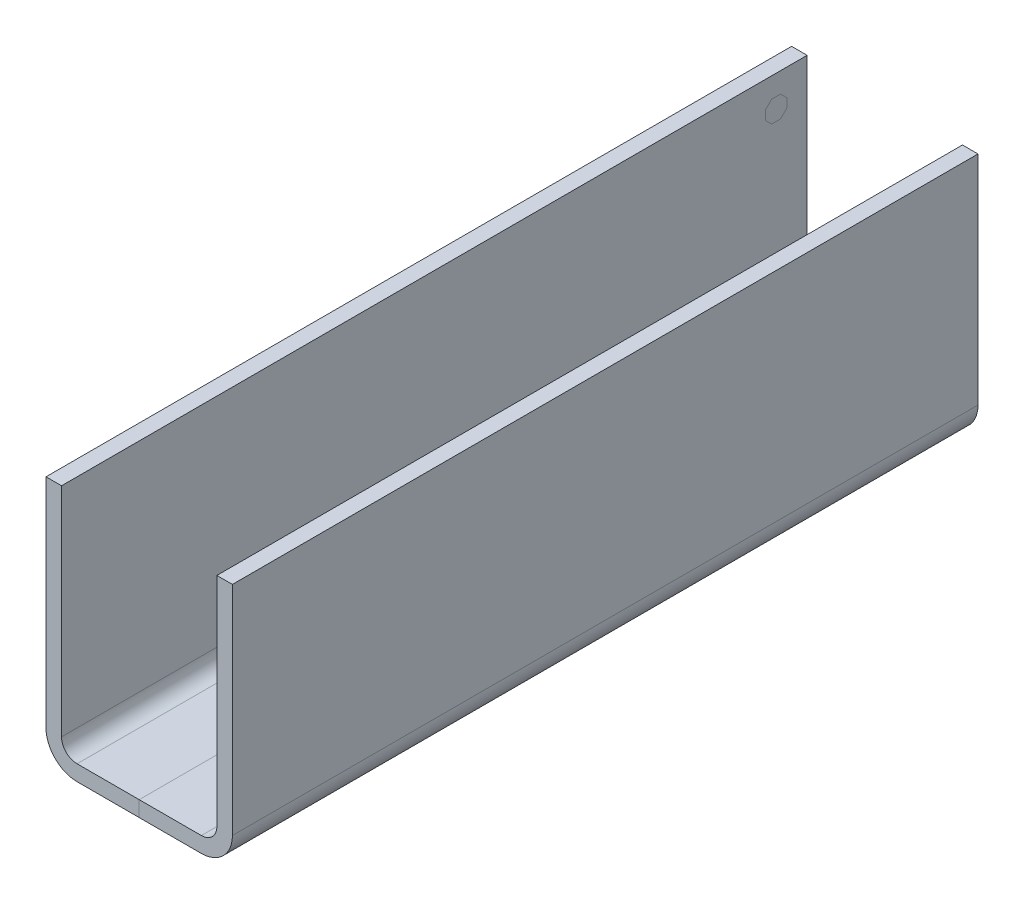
ISO-10303-21;
HEADER;
FILE_DESCRIPTION(('STEP AP214'),'2;1');
FILE_NAME('part.step','',(''),(''),'','','');
FILE_SCHEMA(('AUTOMOTIVE_DESIGN { 1 0 10303 214 1 1 1 1 }'));
ENDSEC;
DATA;
#1=APPLICATION_CONTEXT('core data for automotive mechanical design processes');
#2=APPLICATION_PROTOCOL_DEFINITION('international standard','automotive_design',2000,#1);
#3=PRODUCT_CONTEXT('',#1,'mechanical');
#4=PRODUCT('Part','Part','',(#3));
#5=PRODUCT_RELATED_PRODUCT_CATEGORY('part','',(#4));
#6=PRODUCT_DEFINITION_FORMATION('','',#4);
#7=PRODUCT_DEFINITION_CONTEXT('part definition',#1,'design');
#8=PRODUCT_DEFINITION('design','',#6,#7);
#9=PRODUCT_DEFINITION_SHAPE('','',#8);
#10=(LENGTH_UNIT() NAMED_UNIT(*) SI_UNIT(.MILLI.,.METRE.));
#11=(NAMED_UNIT(*) PLANE_ANGLE_UNIT() SI_UNIT($,.RADIAN.));
#12=(NAMED_UNIT(*) SI_UNIT($,.STERADIAN.) SOLID_ANGLE_UNIT());
#13=UNCERTAINTY_MEASURE_WITH_UNIT(LENGTH_MEASURE(1.E-05),#10,'distance_accuracy_value','');
#14=(GEOMETRIC_REPRESENTATION_CONTEXT(3) GLOBAL_UNCERTAINTY_ASSIGNED_CONTEXT((#13)) GLOBAL_UNIT_ASSIGNED_CONTEXT((#10,
#11,#12)) REPRESENTATION_CONTEXT('',''));
#15=CARTESIAN_POINT('',(0.,0.,0.));
#16=DIRECTION('',(0.,0.,1.));
#17=DIRECTION('',(1.,0.,0.));
#18=AXIS2_PLACEMENT_3D('',#15,#16,#17);
#19=CARTESIAN_POINT('',(0.,-0.00999999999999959,304.8));
#20=DIRECTION('',(1.,0.,0.));
#21=DIRECTION('',(0.,0.,-1.));
#22=AXIS2_PLACEMENT_3D('',#19,#20,#21);
#23=PLANE('',#22);
#24=DIRECTION('',(0.,0.,1.));
#25=VECTOR('',#24,1.);
#26=CARTESIAN_POINT('',(0.,0.,304.8));
#27=LINE('',#26,#25);
#28=CARTESIAN_POINT('',(0.,0.,-304.8));
#29=VERTEX_POINT('',#28);
#30=CARTESIAN_POINT('',(0.,0.,304.8));
#31=VERTEX_POINT('',#30);
#32=EDGE_CURVE('E155',#29,#31,#27,.T.);
#33=ORIENTED_EDGE('',*,*,#32,.F.);
#34=DIRECTION('',(0.,-1.,0.));
#35=VECTOR('',#34,1.);
#36=CARTESIAN_POINT('',(0.,25.4,-304.8));
#37=LINE('',#36,#35);
#38=CARTESIAN_POINT('',(0.,12.7,-304.8));
#39=VERTEX_POINT('',#38);
#40=EDGE_CURVE('E152',#39,#29,#37,.T.);
#41=ORIENTED_EDGE('',*,*,#40,.F.);
#42=DIRECTION('',(0.,0.,1.));
#43=VECTOR('',#42,1.);
#44=CARTESIAN_POINT('',(0.,12.7,304.8));
#45=LINE('',#44,#43);
#46=CARTESIAN_POINT('',(0.,12.7,304.8));
#47=VERTEX_POINT('',#46);
#48=EDGE_CURVE('E158',#39,#47,#45,.T.);
#49=ORIENTED_EDGE('',*,*,#48,.T.);
#50=DIRECTION('',(0.,-1.,0.));
#51=VECTOR('',#50,1.);
#52=CARTESIAN_POINT('',(0.,25.4,304.8));
#53=LINE('',#52,#51);
#54=EDGE_CURVE('E161',#47,#31,#53,.T.);
#55=ORIENTED_EDGE('',*,*,#54,.T.);
#56=EDGE_LOOP('',(#33,#41,#49,#55));
#57=FACE_BOUND('',#56,.T.);
#58=ADVANCED_FACE('F45',(#57),#23,.T.);
#59=CARTESIAN_POINT('',(-63.5,25.4,304.8));
#60=DIRECTION('',(-1.,0.,0.));
#61=DIRECTION('',(0.,0.,1.));
#62=AXIS2_PLACEMENT_3D('',#59,#60,#61);
#63=PLANE('',#62);
#64=DIRECTION('',(0.,1.,0.));
#65=VECTOR('',#64,1.);
#66=CARTESIAN_POINT('',(-63.5,25.4,-288.19995254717));
#67=LINE('',#66,#65);
#68=CARTESIAN_POINT('',(-63.5,174.154940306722,-288.19995254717));
#69=VERTEX_POINT('',#68);
#70=CARTESIAN_POINT('',(-63.5,181.445059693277,-288.19995254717));
#71=VERTEX_POINT('',#70);
#72=EDGE_CURVE('E183',#69,#71,#67,.T.);
#73=ORIENTED_EDGE('',*,*,#72,.T.);
#74=DIRECTION('',(0.,0.707106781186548,0.707106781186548));
#75=VECTOR('',#74,1.);
#76=CARTESIAN_POINT('',(-63.5,399.922506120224,-69.7225061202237));
#77=LINE('',#76,#75);
#78=CARTESIAN_POINT('',(-63.5,186.59995254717,-283.045059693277));
#79=VERTEX_POINT('',#78);
#80=EDGE_CURVE('E211',#71,#79,#77,.T.);
#81=ORIENTED_EDGE('',*,*,#80,.T.);
#82=DIRECTION('',(0.,0.,1.));
#83=VECTOR('',#82,1.);
#84=CARTESIAN_POINT('',(-63.5,186.59995254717,304.8));
#85=LINE('',#84,#83);
#86=CARTESIAN_POINT('',(-63.5,186.59995254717,-275.754940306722));
#87=VERTEX_POINT('',#86);
#88=EDGE_CURVE('E207',#79,#87,#85,.T.);
#89=ORIENTED_EDGE('',*,*,#88,.T.);
#90=DIRECTION('',(0.,-0.707106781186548,0.707106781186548));
#91=VECTOR('',#90,1.);
#92=CARTESIAN_POINT('',(-63.5,-184.277493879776,95.1225061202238));
#93=LINE('',#92,#91);
#94=CARTESIAN_POINT('',(-63.5,181.445059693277,-270.60004745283));
#95=VERTEX_POINT('',#94);
#96=EDGE_CURVE('E203',#87,#95,#93,.T.);
#97=ORIENTED_EDGE('',*,*,#96,.T.);
#98=DIRECTION('',(0.,-1.,0.));
#99=VECTOR('',#98,1.);
#100=CARTESIAN_POINT('',(-63.5,25.4,-270.60004745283));
#101=LINE('',#100,#99);
#102=CARTESIAN_POINT('',(-63.5,174.154940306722,-270.60004745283));
#103=VERTEX_POINT('',#102);
#104=EDGE_CURVE('E199',#95,#103,#101,.T.);
#105=ORIENTED_EDGE('',*,*,#104,.T.);
#106=DIRECTION('',(0.,-0.707106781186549,-0.707106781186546));
#107=VECTOR('',#106,1.);
#108=CARTESIAN_POINT('',(-63.5,387.477493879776,-57.2774938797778));
#109=LINE('',#108,#107);
#110=CARTESIAN_POINT('',(-63.5,169.00004745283,-275.754940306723));
#111=VERTEX_POINT('',#110);
#112=EDGE_CURVE('E195',#103,#111,#109,.T.);
#113=ORIENTED_EDGE('',*,*,#112,.T.);
#114=DIRECTION('',(0.,0.,-1.));
#115=VECTOR('',#114,1.);
#116=CARTESIAN_POINT('',(-63.5,169.000047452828,304.800000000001));
#117=LINE('',#116,#115);
#118=CARTESIAN_POINT('',(-63.5,169.00004745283,-283.045059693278));
#119=VERTEX_POINT('',#118);
#120=EDGE_CURVE('E191',#111,#119,#117,.T.);
#121=ORIENTED_EDGE('',*,*,#120,.T.);
#122=DIRECTION('',(0.,0.707106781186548,-0.707106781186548));
#123=VECTOR('',#122,1.);
#124=CARTESIAN_POINT('',(-63.5,-196.722506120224,82.6774938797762));
#125=LINE('',#124,#123);
#126=EDGE_CURVE('E187',#119,#69,#125,.T.);
#127=ORIENTED_EDGE('',*,*,#126,.T.);
#128=EDGE_LOOP('',(#73,#81,#89,#97,#105,#113,#121,#127));
#129=FACE_BOUND('',#128,.T.);
#130=ADVANCED_FACE('F264',(#129),#63,.F.);
#131=CARTESIAN_POINT('',(-76.2,25.4,304.8));
#132=DIRECTION('',(-1.,0.,0.));
#133=DIRECTION('',(0.,0.,1.));
#134=AXIS2_PLACEMENT_3D('',#131,#132,#133);
#135=PLANE('',#134);
#136=DIRECTION('',(0.,1.,0.));
#137=VECTOR('',#136,1.);
#138=CARTESIAN_POINT('',(-76.2,25.4,-262.571785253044));
#139=LINE('',#138,#137);
#140=CARTESIAN_POINT('',(-76.2,48.5543165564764,-262.571785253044));
#141=VERTEX_POINT('',#140);
#142=CARTESIAN_POINT('',(-76.2,171.381476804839,-262.571785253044));
#143=VERTEX_POINT('',#142);
#144=EDGE_CURVE('E154',#141,#143,#139,.T.);
#145=ORIENTED_EDGE('',*,*,#144,.F.);
#146=DIRECTION('',(0.,0.,-1.));
#147=VECTOR('',#146,1.);
#148=CARTESIAN_POINT('',(-76.2,48.5543165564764,304.8));
#149=LINE('',#148,#147);
#150=CARTESIAN_POINT('',(-76.2,48.5543165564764,-204.751536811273));
#151=VERTEX_POINT('',#150);
#152=EDGE_CURVE('E223',#151,#141,#149,.T.);
#153=ORIENTED_EDGE('',*,*,#152,.F.);
#154=DIRECTION('',(0.,-1.,0.));
#155=VECTOR('',#154,1.);
#156=CARTESIAN_POINT('',(-76.2,25.4,-204.751536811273));
#157=LINE('',#156,#155);
#158=CARTESIAN_POINT('',(-76.2,171.381476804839,-204.751536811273));
#159=VERTEX_POINT('',#158);
#160=EDGE_CURVE('E219',#159,#151,#157,.T.);
#161=ORIENTED_EDGE('',*,*,#160,.F.);
#162=DIRECTION('',(0.,0.,1.));
#163=VECTOR('',#162,1.);
#164=CARTESIAN_POINT('',(-76.2,171.381476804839,304.8));
#165=LINE('',#164,#163);
#166=EDGE_CURVE('E215',#143,#159,#165,.T.);
#167=ORIENTED_EDGE('',*,*,#166,.F.);
#168=EDGE_LOOP('',(#145,#153,#161,#167));
#169=FACE_BOUND('',#168,.T.);
#170=ADVANCED_FACE('F241',(#169),#135,.T.);
#171=CARTESIAN_POINT('',(-50.8,25.4,304.8));
#172=DIRECTION('',(0.,0.,-1.));
#173=DIRECTION('',(-1.,0.,0.));
#174=AXIS2_PLACEMENT_3D('',#171,#172,#173);
#175=CYLINDRICAL_SURFACE('',#174,12.7);
#176=CARTESIAN_POINT('',(-50.8,25.4,-304.8));
#177=DIRECTION('',(0.,0.,1.));
#178=DIRECTION('',(1.,0.,0.));
#179=AXIS2_PLACEMENT_3D('',#176,#177,#178);
#180=CIRCLE('',#179,12.7);
#181=CARTESIAN_POINT('',(-50.8,12.7,-304.8));
#182=VERTEX_POINT('',#181);
#183=CARTESIAN_POINT('',(-63.5,25.4,-304.8));
#184=VERTEX_POINT('',#183);
#185=EDGE_CURVE('E98',#182,#184,#180,.F.);
#186=ORIENTED_EDGE('',*,*,#185,.T.);
#187=DIRECTION('',(0.,0.,-1.));
#188=VECTOR('',#187,1.);
#189=CARTESIAN_POINT('',(-63.5,25.4,304.8));
#190=LINE('',#189,#188);
#191=CARTESIAN_POINT('',(-63.5,25.4,304.8));
#192=VERTEX_POINT('',#191);
#193=EDGE_CURVE('E144',#192,#184,#190,.T.);
#194=ORIENTED_EDGE('',*,*,#193,.F.);
#195=CARTESIAN_POINT('',(-50.8,25.4,304.8));
#196=DIRECTION('',(0.,0.,1.));
#197=DIRECTION('',(1.,0.,0.));
#198=AXIS2_PLACEMENT_3D('',#195,#196,#197);
#199=CIRCLE('',#198,12.7);
#200=CARTESIAN_POINT('',(-50.8,12.7,304.8));
#201=VERTEX_POINT('',#200);
#202=EDGE_CURVE('E141',#201,#192,#199,.F.);
#203=ORIENTED_EDGE('',*,*,#202,.F.);
#204=DIRECTION('',(0.,0.,-1.));
#205=VECTOR('',#204,1.);
#206=CARTESIAN_POINT('',(-50.8,12.7,304.8));
#207=LINE('',#206,#205);
#208=EDGE_CURVE('E170',#201,#182,#207,.T.);
#209=ORIENTED_EDGE('',*,*,#208,.T.);
#210=EDGE_LOOP('',(#186,#194,#203,#209));
#211=FACE_BOUND('',#210,.T.);
#212=ADVANCED_FACE('F173',(#211),#175,.F.);
#213=DIRECTION('',(0.,1.,0.));
#214=VECTOR('',#213,1.);
#215=CARTESIAN_POINT('',(-63.5,25.4,-304.8));
#216=LINE('',#215,#214);
#217=CARTESIAN_POINT('',(-63.5,203.2,-304.8));
#218=VERTEX_POINT('',#217);
#219=EDGE_CURVE('E12',#184,#218,#216,.T.);
#220=ORIENTED_EDGE('',*,*,#219,.T.);
#221=DIRECTION('',(0.,0.,-1.));
#222=VECTOR('',#221,1.);
#223=CARTESIAN_POINT('',(-63.5,203.2,304.8));
#224=LINE('',#223,#222);
#225=CARTESIAN_POINT('',(-63.5,203.2,304.8));
#226=VERTEX_POINT('',#225);
#227=EDGE_CURVE('E64',#226,#218,#224,.T.);
#228=ORIENTED_EDGE('',*,*,#227,.F.);
#229=DIRECTION('',(0.,1.,0.));
#230=VECTOR('',#229,1.);
#231=CARTESIAN_POINT('',(-63.5,25.4,304.8));
#232=LINE('',#231,#230);
#233=EDGE_CURVE('E90',#192,#226,#232,.T.);
#234=ORIENTED_EDGE('',*,*,#233,.F.);
#235=ORIENTED_EDGE('',*,*,#193,.T.);
#236=EDGE_LOOP('',(#220,#228,#234,#235));
#237=FACE_BOUND('',#236,.T.);
#238=ORIENTED_EDGE('',*,*,#80,.F.);
#239=ORIENTED_EDGE('',*,*,#72,.F.);
#240=ORIENTED_EDGE('',*,*,#126,.F.);
#241=ORIENTED_EDGE('',*,*,#120,.F.);
#242=ORIENTED_EDGE('',*,*,#112,.F.);
#243=ORIENTED_EDGE('',*,*,#104,.F.);
#244=ORIENTED_EDGE('',*,*,#96,.F.);
#245=ORIENTED_EDGE('',*,*,#88,.F.);
#246=EDGE_LOOP('',(#238,#239,#240,#241,#242,#243,#244,#245));
#247=FACE_BOUND('',#246,.T.);
#248=ADVANCED_FACE('F177',(#237,#247),#63,.F.);
#249=CARTESIAN_POINT('',(-76.2,203.2,304.8));
#250=DIRECTION('',(0.,1.,0.));
#251=DIRECTION('',(-1.,0.,0.));
#252=AXIS2_PLACEMENT_3D('',#249,#250,#251);
#253=PLANE('',#252);
#254=DIRECTION('',(1.,0.,0.));
#255=VECTOR('',#254,1.);
#256=CARTESIAN_POINT('',(-76.2,203.2,-304.8));
#257=LINE('',#256,#255);
#258=CARTESIAN_POINT('',(-76.2,203.2,-304.8));
#259=VERTEX_POINT('',#258);
#260=EDGE_CURVE('E55',#259,#218,#257,.T.);
#261=ORIENTED_EDGE('',*,*,#260,.F.);
#262=DIRECTION('',(0.,0.,-1.));
#263=VECTOR('',#262,1.);
#264=CARTESIAN_POINT('',(-76.2,203.2,304.8));
#265=LINE('',#264,#263);
#266=CARTESIAN_POINT('',(-76.2,203.2,304.8));
#267=VERTEX_POINT('',#266);
#268=EDGE_CURVE('E84',#267,#259,#265,.T.);
#269=ORIENTED_EDGE('',*,*,#268,.F.);
#270=DIRECTION('',(1.,0.,0.));
#271=VECTOR('',#270,1.);
#272=CARTESIAN_POINT('',(-76.2,203.2,304.8));
#273=LINE('',#272,#271);
#274=EDGE_CURVE('E149',#267,#226,#273,.T.);
#275=ORIENTED_EDGE('',*,*,#274,.T.);
#276=ORIENTED_EDGE('',*,*,#227,.T.);
#277=EDGE_LOOP('',(#261,#269,#275,#276));
#278=FACE_BOUND('',#277,.T.);
#279=ADVANCED_FACE('F267',(#278),#253,.T.);
#280=DIRECTION('',(0.,1.,0.));
#281=VECTOR('',#280,1.);
#282=CARTESIAN_POINT('',(-76.2,25.4,-304.8));
#283=LINE('',#282,#281);
#284=CARTESIAN_POINT('',(-76.2,25.4,-304.8));
#285=VERTEX_POINT('',#284);
#286=EDGE_CURVE('E125',#285,#259,#283,.T.);
#287=ORIENTED_EDGE('',*,*,#286,.F.);
#288=DIRECTION('',(0.,0.,-1.));
#289=VECTOR('',#288,1.);
#290=CARTESIAN_POINT('',(-76.2,25.4,304.8));
#291=LINE('',#290,#289);
#292=CARTESIAN_POINT('',(-76.2,25.4,304.8));
#293=VERTEX_POINT('',#292);
#294=EDGE_CURVE('E111',#293,#285,#291,.T.);
#295=ORIENTED_EDGE('',*,*,#294,.F.);
#296=DIRECTION('',(0.,1.,0.));
#297=VECTOR('',#296,1.);
#298=CARTESIAN_POINT('',(-76.2,25.4,304.8));
#299=LINE('',#298,#297);
#300=EDGE_CURVE('E146',#293,#267,#299,.T.);
#301=ORIENTED_EDGE('',*,*,#300,.T.);
#302=ORIENTED_EDGE('',*,*,#268,.T.);
#303=EDGE_LOOP('',(#287,#295,#301,#302));
#304=FACE_BOUND('',#303,.T.);
#305=ORIENTED_EDGE('',*,*,#152,.T.);
#306=ORIENTED_EDGE('',*,*,#144,.T.);
#307=ORIENTED_EDGE('',*,*,#166,.T.);
#308=ORIENTED_EDGE('',*,*,#160,.T.);
#309=EDGE_LOOP('',(#305,#306,#307,#308));
#310=FACE_BOUND('',#309,.T.);
#311=ADVANCED_FACE('F126',(#304,#310),#135,.T.);
#312=CARTESIAN_POINT('',(-50.8,25.4,304.8));
#313=DIRECTION('',(0.,0.,-1.));
#314=DIRECTION('',(-1.,0.,0.));
#315=AXIS2_PLACEMENT_3D('',#312,#313,#314);
#316=CYLINDRICAL_SURFACE('',#315,25.4);
#317=CARTESIAN_POINT('',(-50.8,25.4,-304.8));
#318=DIRECTION('',(0.,0.,-1.));
#319=DIRECTION('',(-1.,0.,0.));
#320=AXIS2_PLACEMENT_3D('',#317,#318,#319);
#321=CIRCLE('',#320,25.4);
#322=CARTESIAN_POINT('',(-50.8,0.,-304.8));
#323=VERTEX_POINT('',#322);
#324=EDGE_CURVE('E116',#323,#285,#321,.T.);
#325=ORIENTED_EDGE('',*,*,#324,.F.);
#326=DIRECTION('',(0.,0.,-1.));
#327=VECTOR('',#326,1.);
#328=CARTESIAN_POINT('',(-50.8,0.,304.8));
#329=LINE('',#328,#327);
#330=CARTESIAN_POINT('',(-50.8,0.,304.8));
#331=VERTEX_POINT('',#330);
#332=EDGE_CURVE('E122',#331,#323,#329,.T.);
#333=ORIENTED_EDGE('',*,*,#332,.F.);
#334=CARTESIAN_POINT('',(-50.8,25.4,304.8));
#335=DIRECTION('',(0.,0.,-1.));
#336=DIRECTION('',(-1.,0.,0.));
#337=AXIS2_PLACEMENT_3D('',#334,#335,#336);
#338=CIRCLE('',#337,25.4);
#339=EDGE_CURVE('E118',#331,#293,#338,.T.);
#340=ORIENTED_EDGE('',*,*,#339,.T.);
#341=ORIENTED_EDGE('',*,*,#294,.T.);
#342=EDGE_LOOP('',(#325,#333,#340,#341));
#343=FACE_BOUND('',#342,.T.);
#344=ADVANCED_FACE('F113',(#343),#316,.T.);
#345=CARTESIAN_POINT('',(-50.8,0.,304.8));
#346=DIRECTION('',(0.,-1.,0.));
#347=DIRECTION('',(0.,0.,-1.));
#348=AXIS2_PLACEMENT_3D('',#345,#346,#347);
#349=PLANE('',#348);
#350=DIRECTION('',(-1.,0.,0.));
#351=VECTOR('',#350,1.);
#352=CARTESIAN_POINT('',(-50.8,0.,-304.8));
#353=LINE('',#352,#351);
#354=EDGE_CURVE('E49',#29,#323,#353,.T.);
#355=ORIENTED_EDGE('',*,*,#354,.F.);
#356=ORIENTED_EDGE('',*,*,#32,.T.);
#357=DIRECTION('',(-1.,0.,0.));
#358=VECTOR('',#357,1.);
#359=CARTESIAN_POINT('',(-50.8,0.,304.8));
#360=LINE('',#359,#358);
#361=EDGE_CURVE('E147',#31,#331,#360,.T.);
#362=ORIENTED_EDGE('',*,*,#361,.T.);
#363=ORIENTED_EDGE('',*,*,#332,.T.);
#364=EDGE_LOOP('',(#355,#356,#362,#363));
#365=FACE_BOUND('',#364,.T.);
#366=ADVANCED_FACE('F295',(#365),#349,.T.);
#367=CARTESIAN_POINT('',(-50.8,12.7,304.8));
#368=DIRECTION('',(0.,-1.,0.));
#369=DIRECTION('',(0.,0.,-1.));
#370=AXIS2_PLACEMENT_3D('',#367,#368,#369);
#371=PLANE('',#370);
#372=ORIENTED_EDGE('',*,*,#48,.F.);
#373=DIRECTION('',(1.,0.,0.));
#374=VECTOR('',#373,1.);
#375=CARTESIAN_POINT('',(-50.8,12.7,-304.8));
#376=LINE('',#375,#374);
#377=EDGE_CURVE('E136',#39,#182,#376,.F.);
#378=ORIENTED_EDGE('',*,*,#377,.T.);
#379=ORIENTED_EDGE('',*,*,#208,.F.);
#380=DIRECTION('',(1.,0.,0.));
#381=VECTOR('',#380,1.);
#382=CARTESIAN_POINT('',(-50.8,12.7,304.8));
#383=LINE('',#382,#381);
#384=EDGE_CURVE('E143',#47,#201,#383,.F.);
#385=ORIENTED_EDGE('',*,*,#384,.F.);
#386=EDGE_LOOP('',(#372,#378,#379,#385));
#387=FACE_BOUND('',#386,.T.);
#388=ADVANCED_FACE('F168',(#387),#371,.F.);
#389=CARTESIAN_POINT('',(-50.8,25.4,-304.8));
#390=DIRECTION('',(0.,0.,-1.));
#391=DIRECTION('',(-1.,0.,0.));
#392=AXIS2_PLACEMENT_3D('',#389,#390,#391);
#393=PLANE('',#392);
#394=ORIENTED_EDGE('',*,*,#377,.F.);
#395=ORIENTED_EDGE('',*,*,#40,.T.);
#396=ORIENTED_EDGE('',*,*,#354,.T.);
#397=ORIENTED_EDGE('',*,*,#324,.T.);
#398=ORIENTED_EDGE('',*,*,#286,.T.);
#399=ORIENTED_EDGE('',*,*,#260,.T.);
#400=ORIENTED_EDGE('',*,*,#219,.F.);
#401=ORIENTED_EDGE('',*,*,#185,.F.);
#402=EDGE_LOOP('',(#394,#395,#396,#397,#398,#399,#400,#401));
#403=FACE_BOUND('',#402,.T.);
#404=ADVANCED_FACE('F47',(#403),#393,.T.);
#405=CARTESIAN_POINT('',(-50.8,25.4,304.8));
#406=DIRECTION('',(0.,0.,-1.));
#407=DIRECTION('',(-1.,0.,0.));
#408=AXIS2_PLACEMENT_3D('',#405,#406,#407);
#409=PLANE('',#408);
#410=ORIENTED_EDGE('',*,*,#54,.F.);
#411=ORIENTED_EDGE('',*,*,#384,.T.);
#412=ORIENTED_EDGE('',*,*,#202,.T.);
#413=ORIENTED_EDGE('',*,*,#233,.T.);
#414=ORIENTED_EDGE('',*,*,#274,.F.);
#415=ORIENTED_EDGE('',*,*,#300,.F.);
#416=ORIENTED_EDGE('',*,*,#339,.F.);
#417=ORIENTED_EDGE('',*,*,#361,.F.);
#418=EDGE_LOOP('',(#410,#411,#412,#413,#414,#415,#416,#417));
#419=FACE_BOUND('',#418,.T.);
#420=ADVANCED_FACE('F283',(#419),#409,.F.);
#421=CLOSED_SHELL('',(#58,#130,#170,#212,#248,#279,#311,#344,#366,#388,#404,#420));
#422=MANIFOLD_SOLID_BREP('B2',#421);
#423=CARTESIAN_POINT('',(0.,-0.00999999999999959,304.8));
#424=DIRECTION('',(1.,0.,0.));
#425=DIRECTION('',(0.,0.,-1.));
#426=AXIS2_PLACEMENT_3D('',#423,#424,#425);
#427=PLANE('',#426);
#428=DIRECTION('',(0.,0.,1.));
#429=VECTOR('',#428,1.);
#430=CARTESIAN_POINT('',(0.,0.,304.8));
#431=LINE('',#430,#429);
#432=CARTESIAN_POINT('',(0.,0.,-304.8));
#433=VERTEX_POINT('',#432);
#434=CARTESIAN_POINT('',(0.,0.,304.8));
#435=VERTEX_POINT('',#434);
#436=EDGE_CURVE('E416',#433,#435,#431,.T.);
#437=ORIENTED_EDGE('',*,*,#436,.T.);
#438=DIRECTION('',(0.,-1.,0.));
#439=VECTOR('',#438,1.);
#440=CARTESIAN_POINT('',(0.,25.4,304.8));
#441=LINE('',#440,#439);
#442=CARTESIAN_POINT('',(0.,12.7,304.8));
#443=VERTEX_POINT('',#442);
#444=EDGE_CURVE('E520',#443,#435,#441,.T.);
#445=ORIENTED_EDGE('',*,*,#444,.F.);
#446=DIRECTION('',(0.,0.,1.));
#447=VECTOR('',#446,1.);
#448=CARTESIAN_POINT('',(0.,12.7,304.8));
#449=LINE('',#448,#447);
#450=CARTESIAN_POINT('',(0.,12.7,-304.8));
#451=VERTEX_POINT('',#450);
#452=EDGE_CURVE('E593',#451,#443,#449,.T.);
#453=ORIENTED_EDGE('',*,*,#452,.F.);
#454=DIRECTION('',(0.,-1.,0.));
#455=VECTOR('',#454,1.);
#456=CARTESIAN_POINT('',(0.,25.4,-304.8));
#457=LINE('',#456,#455);
#458=EDGE_CURVE('E43',#451,#433,#457,.T.);
#459=ORIENTED_EDGE('',*,*,#458,.T.);
#460=EDGE_LOOP('',(#437,#445,#453,#459));
#461=FACE_BOUND('',#460,.T.);
#462=ADVANCED_FACE('F413',(#461),#427,.F.);
#463=CARTESIAN_POINT('',(63.5,25.4,304.8));
#464=DIRECTION('',(1.,0.,0.));
#465=DIRECTION('',(0.,0.,-1.));
#466=AXIS2_PLACEMENT_3D('',#463,#464,#465);
#467=PLANE('',#466);
#468=DIRECTION('',(0.,1.,0.));
#469=VECTOR('',#468,1.);
#470=CARTESIAN_POINT('',(63.5,25.4,-304.8));
#471=LINE('',#470,#469);
#472=CARTESIAN_POINT('',(63.5,203.2,-304.8));
#473=VERTEX_POINT('',#472);
#474=CARTESIAN_POINT('',(63.5,25.4,-304.8));
#475=VERTEX_POINT('',#474);
#476=EDGE_CURVE('E547',#473,#475,#471,.F.);
#477=ORIENTED_EDGE('',*,*,#476,.T.);
#478=DIRECTION('',(0.,0.,-1.));
#479=VECTOR('',#478,1.);
#480=CARTESIAN_POINT('',(63.5,25.4,304.8));
#481=LINE('',#480,#479);
#482=CARTESIAN_POINT('',(63.5,25.4,304.8));
#483=VERTEX_POINT('',#482);
#484=EDGE_CURVE('E555',#483,#475,#481,.T.);
#485=ORIENTED_EDGE('',*,*,#484,.F.);
#486=DIRECTION('',(0.,1.,0.));
#487=VECTOR('',#486,1.);
#488=CARTESIAN_POINT('',(63.5,25.4,304.8));
#489=LINE('',#488,#487);
#490=CARTESIAN_POINT('',(63.5,203.2,304.8));
#491=VERTEX_POINT('',#490);
#492=EDGE_CURVE('E531',#491,#483,#489,.F.);
#493=ORIENTED_EDGE('',*,*,#492,.F.);
#494=DIRECTION('',(0.,0.,-1.));
#495=VECTOR('',#494,1.);
#496=CARTESIAN_POINT('',(63.5,203.2,304.8));
#497=LINE('',#496,#495);
#498=EDGE_CURVE('E558',#491,#473,#497,.T.);
#499=ORIENTED_EDGE('',*,*,#498,.T.);
#500=EDGE_LOOP('',(#477,#485,#493,#499));
#501=FACE_BOUND('',#500,.T.);
#502=DIRECTION('',(0.,-0.707106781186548,-0.707106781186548));
#503=VECTOR('',#502,1.);
#504=CARTESIAN_POINT('',(63.5,399.922506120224,-69.7225061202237));
#505=LINE('',#504,#503);
#506=CARTESIAN_POINT('',(63.5,186.59995254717,-283.045059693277));
#507=VERTEX_POINT('',#506);
#508=CARTESIAN_POINT('',(63.5,181.445059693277,-288.19995254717));
#509=VERTEX_POINT('',#508);
#510=EDGE_CURVE('E563',#507,#509,#505,.T.);
#511=ORIENTED_EDGE('',*,*,#510,.F.);
#512=DIRECTION('',(0.,0.,-1.));
#513=VECTOR('',#512,1.);
#514=CARTESIAN_POINT('',(63.5,186.59995254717,304.8));
#515=LINE('',#514,#513);
#516=CARTESIAN_POINT('',(63.5,186.59995254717,-275.754940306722));
#517=VERTEX_POINT('',#516);
#518=EDGE_CURVE('E566',#517,#507,#515,.T.);
#519=ORIENTED_EDGE('',*,*,#518,.F.);
#520=DIRECTION('',(0.,0.707106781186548,-0.707106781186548));
#521=VECTOR('',#520,1.);
#522=CARTESIAN_POINT('',(63.5,-184.277493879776,95.1225061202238));
#523=LINE('',#522,#521);
#524=CARTESIAN_POINT('',(63.5,181.445059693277,-270.60004745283));
#525=VERTEX_POINT('',#524);
#526=EDGE_CURVE('E570',#525,#517,#523,.T.);
#527=ORIENTED_EDGE('',*,*,#526,.F.);
#528=DIRECTION('',(0.,1.,0.));
#529=VECTOR('',#528,1.);
#530=CARTESIAN_POINT('',(63.5,25.4,-270.60004745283));
#531=LINE('',#530,#529);
#532=CARTESIAN_POINT('',(63.5,174.154940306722,-270.60004745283));
#533=VERTEX_POINT('',#532);
#534=EDGE_CURVE('E574',#533,#525,#531,.T.);
#535=ORIENTED_EDGE('',*,*,#534,.F.);
#536=DIRECTION('',(0.,0.707106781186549,0.707106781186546));
#537=VECTOR('',#536,1.);
#538=CARTESIAN_POINT('',(63.5,387.477493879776,-57.2774938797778));
#539=LINE('',#538,#537);
#540=CARTESIAN_POINT('',(63.5,169.00004745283,-275.754940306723));
#541=VERTEX_POINT('',#540);
#542=EDGE_CURVE('E578',#541,#533,#539,.T.);
#543=ORIENTED_EDGE('',*,*,#542,.F.);
#544=DIRECTION('',(0.,0.,1.));
#545=VECTOR('',#544,1.);
#546=CARTESIAN_POINT('',(63.5,169.000047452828,304.800000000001));
#547=LINE('',#546,#545);
#548=CARTESIAN_POINT('',(63.5,169.00004745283,-283.045059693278));
#549=VERTEX_POINT('',#548);
#550=EDGE_CURVE('E582',#549,#541,#547,.T.);
#551=ORIENTED_EDGE('',*,*,#550,.F.);
#552=DIRECTION('',(0.,-0.707106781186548,0.707106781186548));
#553=VECTOR('',#552,1.);
#554=CARTESIAN_POINT('',(63.5,-196.722506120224,82.6774938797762));
#555=LINE('',#554,#553);
#556=CARTESIAN_POINT('',(63.5,174.154940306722,-288.19995254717));
#557=VERTEX_POINT('',#556);
#558=EDGE_CURVE('E586',#557,#549,#555,.T.);
#559=ORIENTED_EDGE('',*,*,#558,.F.);
#560=DIRECTION('',(0.,-1.,0.));
#561=VECTOR('',#560,1.);
#562=CARTESIAN_POINT('',(63.5,25.4,-288.19995254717));
#563=LINE('',#562,#561);
#564=EDGE_CURVE('E509',#509,#557,#563,.T.);
#565=ORIENTED_EDGE('',*,*,#564,.F.);
#566=EDGE_LOOP('',(#511,#519,#527,#535,#543,#551,#559,#565));
#567=FACE_BOUND('',#566,.T.);
#568=ADVANCED_FACE('F608',(#501,#567),#467,.F.);
#569=CARTESIAN_POINT('',(-50.8,0.,304.8));
#570=DIRECTION('',(0.,-1.,0.));
#571=DIRECTION('',(0.,0.,-1.));
#572=AXIS2_PLACEMENT_3D('',#569,#570,#571);
#573=PLANE('',#572);
#574=ORIENTED_EDGE('',*,*,#436,.F.);
#575=DIRECTION('',(-1.,0.,0.));
#576=VECTOR('',#575,1.);
#577=CARTESIAN_POINT('',(-50.8,0.,-304.8));
#578=LINE('',#577,#576);
#579=CARTESIAN_POINT('',(50.8,0.,-304.8));
#580=VERTEX_POINT('',#579);
#581=EDGE_CURVE('E504',#580,#433,#578,.T.);
#582=ORIENTED_EDGE('',*,*,#581,.F.);
#583=DIRECTION('',(0.,0.,-1.));
#584=VECTOR('',#583,1.);
#585=CARTESIAN_POINT('',(50.8,0.,304.8));
#586=LINE('',#585,#584);
#587=CARTESIAN_POINT('',(50.8,0.,304.8));
#588=VERTEX_POINT('',#587);
#589=EDGE_CURVE('E500',#588,#580,#586,.T.);
#590=ORIENTED_EDGE('',*,*,#589,.F.);
#591=DIRECTION('',(-1.,0.,0.));
#592=VECTOR('',#591,1.);
#593=CARTESIAN_POINT('',(-50.8,0.,304.8));
#594=LINE('',#593,#592);
#595=EDGE_CURVE('E503',#588,#435,#594,.T.);
#596=ORIENTED_EDGE('',*,*,#595,.T.);
#597=EDGE_LOOP('',(#574,#582,#590,#596));
#598=FACE_BOUND('',#597,.T.);
#599=ADVANCED_FACE('F502',(#598),#573,.T.);
#600=CARTESIAN_POINT('',(50.8,25.4,304.8));
#601=DIRECTION('',(0.,0.,-1.));
#602=DIRECTION('',(-1.,0.,0.));
#603=AXIS2_PLACEMENT_3D('',#600,#601,#602);
#604=CYLINDRICAL_SURFACE('',#603,25.4);
#605=CARTESIAN_POINT('',(50.8,25.4,-304.8));
#606=DIRECTION('',(0.,0.,-1.));
#607=DIRECTION('',(1.,0.,0.));
#608=AXIS2_PLACEMENT_3D('',#605,#606,#607);
#609=CIRCLE('',#608,25.4);
#610=CARTESIAN_POINT('',(76.2,25.4,-304.8));
#611=VERTEX_POINT('',#610);
#612=EDGE_CURVE('E539',#611,#580,#609,.T.);
#613=ORIENTED_EDGE('',*,*,#612,.F.);
#614=DIRECTION('',(0.,0.,-1.));
#615=VECTOR('',#614,1.);
#616=CARTESIAN_POINT('',(76.2,25.4,304.8));
#617=LINE('',#616,#615);
#618=CARTESIAN_POINT('',(76.2,25.4,304.8));
#619=VERTEX_POINT('',#618);
#620=EDGE_CURVE('E510',#619,#611,#617,.T.);
#621=ORIENTED_EDGE('',*,*,#620,.F.);
#622=CARTESIAN_POINT('',(50.8,25.4,304.8));
#623=DIRECTION('',(0.,0.,-1.));
#624=DIRECTION('',(1.,0.,0.));
#625=AXIS2_PLACEMENT_3D('',#622,#623,#624);
#626=CIRCLE('',#625,25.4);
#627=EDGE_CURVE('E517',#619,#588,#626,.T.);
#628=ORIENTED_EDGE('',*,*,#627,.T.);
#629=ORIENTED_EDGE('',*,*,#589,.T.);
#630=EDGE_LOOP('',(#613,#621,#628,#629));
#631=FACE_BOUND('',#630,.T.);
#632=ADVANCED_FACE('F523',(#631),#604,.T.);
#633=CARTESIAN_POINT('',(76.2,25.4,304.8));
#634=DIRECTION('',(1.,0.,0.));
#635=DIRECTION('',(0.,0.,-1.));
#636=AXIS2_PLACEMENT_3D('',#633,#634,#635);
#637=PLANE('',#636);
#638=DIRECTION('',(0.,-1.,0.));
#639=VECTOR('',#638,1.);
#640=CARTESIAN_POINT('',(76.2,25.4,-304.8));
#641=LINE('',#640,#639);
#642=CARTESIAN_POINT('',(76.2,203.2,-304.8));
#643=VERTEX_POINT('',#642);
#644=EDGE_CURVE('E541',#643,#611,#641,.T.);
#645=ORIENTED_EDGE('',*,*,#644,.F.);
#646=DIRECTION('',(0.,0.,-1.));
#647=VECTOR('',#646,1.);
#648=CARTESIAN_POINT('',(76.2,203.2,304.8));
#649=LINE('',#648,#647);
#650=CARTESIAN_POINT('',(76.2,203.2,304.8));
#651=VERTEX_POINT('',#650);
#652=EDGE_CURVE('E560',#651,#643,#649,.T.);
#653=ORIENTED_EDGE('',*,*,#652,.F.);
#654=DIRECTION('',(0.,-1.,0.));
#655=VECTOR('',#654,1.);
#656=CARTESIAN_POINT('',(76.2,25.4,304.8));
#657=LINE('',#656,#655);
#658=EDGE_CURVE('E524',#651,#619,#657,.T.);
#659=ORIENTED_EDGE('',*,*,#658,.T.);
#660=ORIENTED_EDGE('',*,*,#620,.T.);
#661=EDGE_LOOP('',(#645,#653,#659,#660));
#662=FACE_BOUND('',#661,.T.);
#663=ADVANCED_FACE('F601',(#662),#637,.T.);
#664=CARTESIAN_POINT('',(63.5,203.2,304.8));
#665=DIRECTION('',(0.,1.,0.));
#666=DIRECTION('',(-1.,0.,0.));
#667=AXIS2_PLACEMENT_3D('',#664,#665,#666);
#668=PLANE('',#667);
#669=DIRECTION('',(1.,0.,0.));
#670=VECTOR('',#669,1.);
#671=CARTESIAN_POINT('',(63.5,203.2,-304.8));
#672=LINE('',#671,#670);
#673=EDGE_CURVE('E544',#473,#643,#672,.T.);
#674=ORIENTED_EDGE('',*,*,#673,.F.);
#675=ORIENTED_EDGE('',*,*,#498,.F.);
#676=DIRECTION('',(1.,0.,0.));
#677=VECTOR('',#676,1.);
#678=CARTESIAN_POINT('',(63.5,203.2,304.8));
#679=LINE('',#678,#677);
#680=EDGE_CURVE('E526',#491,#651,#679,.T.);
#681=ORIENTED_EDGE('',*,*,#680,.T.);
#682=ORIENTED_EDGE('',*,*,#652,.T.);
#683=EDGE_LOOP('',(#674,#675,#681,#682));
#684=FACE_BOUND('',#683,.T.);
#685=ADVANCED_FACE('F604',(#684),#668,.T.);
#686=ORIENTED_EDGE('',*,*,#518,.T.);
#687=ORIENTED_EDGE('',*,*,#510,.T.);
#688=ORIENTED_EDGE('',*,*,#564,.T.);
#689=ORIENTED_EDGE('',*,*,#558,.T.);
#690=ORIENTED_EDGE('',*,*,#550,.T.);
#691=ORIENTED_EDGE('',*,*,#542,.T.);
#692=ORIENTED_EDGE('',*,*,#534,.T.);
#693=ORIENTED_EDGE('',*,*,#526,.T.);
#694=EDGE_LOOP('',(#686,#687,#688,#689,#690,#691,#692,#693));
#695=FACE_BOUND('',#694,.T.);
#696=ADVANCED_FACE('F623',(#695),#467,.F.);
#697=CARTESIAN_POINT('',(50.8,25.4,304.8));
#698=DIRECTION('',(0.,0.,-1.));
#699=DIRECTION('',(-1.,0.,0.));
#700=AXIS2_PLACEMENT_3D('',#697,#698,#699);
#701=CYLINDRICAL_SURFACE('',#700,12.7);
#702=CARTESIAN_POINT('',(50.8,25.4,-304.8));
#703=DIRECTION('',(0.,0.,1.));
#704=DIRECTION('',(1.,0.,0.));
#705=AXIS2_PLACEMENT_3D('',#702,#703,#704);
#706=CIRCLE('',#705,12.7);
#707=CARTESIAN_POINT('',(50.8,12.7,-304.8));
#708=VERTEX_POINT('',#707);
#709=EDGE_CURVE('E549',#475,#708,#706,.F.);
#710=ORIENTED_EDGE('',*,*,#709,.T.);
#711=DIRECTION('',(0.,0.,-1.));
#712=VECTOR('',#711,1.);
#713=CARTESIAN_POINT('',(50.8,12.7,304.8));
#714=LINE('',#713,#712);
#715=CARTESIAN_POINT('',(50.8,12.7,304.8));
#716=VERTEX_POINT('',#715);
#717=EDGE_CURVE('E537',#716,#708,#714,.T.);
#718=ORIENTED_EDGE('',*,*,#717,.F.);
#719=CARTESIAN_POINT('',(50.8,25.4,304.8));
#720=DIRECTION('',(0.,0.,1.));
#721=DIRECTION('',(1.,0.,0.));
#722=AXIS2_PLACEMENT_3D('',#719,#720,#721);
#723=CIRCLE('',#722,12.7);
#724=EDGE_CURVE('E533',#483,#716,#723,.F.);
#725=ORIENTED_EDGE('',*,*,#724,.F.);
#726=ORIENTED_EDGE('',*,*,#484,.T.);
#727=EDGE_LOOP('',(#710,#718,#725,#726));
#728=FACE_BOUND('',#727,.T.);
#729=ADVANCED_FACE('F613',(#728),#701,.F.);
#730=CARTESIAN_POINT('',(-50.8,12.7,304.8));
#731=DIRECTION('',(0.,-1.,0.));
#732=DIRECTION('',(0.,0.,-1.));
#733=AXIS2_PLACEMENT_3D('',#730,#731,#732);
#734=PLANE('',#733);
#735=DIRECTION('',(1.,0.,0.));
#736=VECTOR('',#735,1.);
#737=CARTESIAN_POINT('',(-50.8,12.7,-304.8));
#738=LINE('',#737,#736);
#739=EDGE_CURVE('E521',#708,#451,#738,.F.);
#740=ORIENTED_EDGE('',*,*,#739,.T.);
#741=ORIENTED_EDGE('',*,*,#452,.T.);
#742=DIRECTION('',(1.,0.,0.));
#743=VECTOR('',#742,1.);
#744=CARTESIAN_POINT('',(-50.8,12.7,304.8));
#745=LINE('',#744,#743);
#746=EDGE_CURVE('E535',#716,#443,#745,.F.);
#747=ORIENTED_EDGE('',*,*,#746,.F.);
#748=ORIENTED_EDGE('',*,*,#717,.T.);
#749=EDGE_LOOP('',(#740,#741,#747,#748));
#750=FACE_BOUND('',#749,.T.);
#751=ADVANCED_FACE('F615',(#750),#734,.F.);
#752=CARTESIAN_POINT('',(-50.8,25.4,304.8));
#753=DIRECTION('',(0.,0.,-1.));
#754=DIRECTION('',(-1.,0.,0.));
#755=AXIS2_PLACEMENT_3D('',#752,#753,#754);
#756=PLANE('',#755);
#757=ORIENTED_EDGE('',*,*,#746,.T.);
#758=ORIENTED_EDGE('',*,*,#444,.T.);
#759=ORIENTED_EDGE('',*,*,#595,.F.);
#760=ORIENTED_EDGE('',*,*,#627,.F.);
#761=ORIENTED_EDGE('',*,*,#658,.F.);
#762=ORIENTED_EDGE('',*,*,#680,.F.);
#763=ORIENTED_EDGE('',*,*,#492,.T.);
#764=ORIENTED_EDGE('',*,*,#724,.T.);
#765=EDGE_LOOP('',(#757,#758,#759,#760,#761,#762,#763,#764));
#766=FACE_BOUND('',#765,.T.);
#767=ADVANCED_FACE('F515',(#766),#756,.F.);
#768=CARTESIAN_POINT('',(-50.8,25.4,-304.8));
#769=DIRECTION('',(0.,0.,-1.));
#770=DIRECTION('',(-1.,0.,0.));
#771=AXIS2_PLACEMENT_3D('',#768,#769,#770);
#772=PLANE('',#771);
#773=ORIENTED_EDGE('',*,*,#458,.F.);
#774=ORIENTED_EDGE('',*,*,#739,.F.);
#775=ORIENTED_EDGE('',*,*,#709,.F.);
#776=ORIENTED_EDGE('',*,*,#476,.F.);
#777=ORIENTED_EDGE('',*,*,#673,.T.);
#778=ORIENTED_EDGE('',*,*,#644,.T.);
#779=ORIENTED_EDGE('',*,*,#612,.T.);
#780=ORIENTED_EDGE('',*,*,#581,.T.);
#781=EDGE_LOOP('',(#773,#774,#775,#776,#777,#778,#779,#780));
#782=FACE_BOUND('',#781,.T.);
#783=ADVANCED_FACE('F596',(#782),#772,.T.);
#784=CLOSED_SHELL('',(#462,#568,#599,#632,#663,#685,#696,#729,#751,#767,#783));
#785=MANIFOLD_SOLID_BREP('B6',#784);
#786=ADVANCED_BREP_SHAPE_REPRESENTATION('',(#18,#422,#785),#14);
#787=SHAPE_DEFINITION_REPRESENTATION(#9,#786);
ENDSEC;
END-ISO-10303-21;
